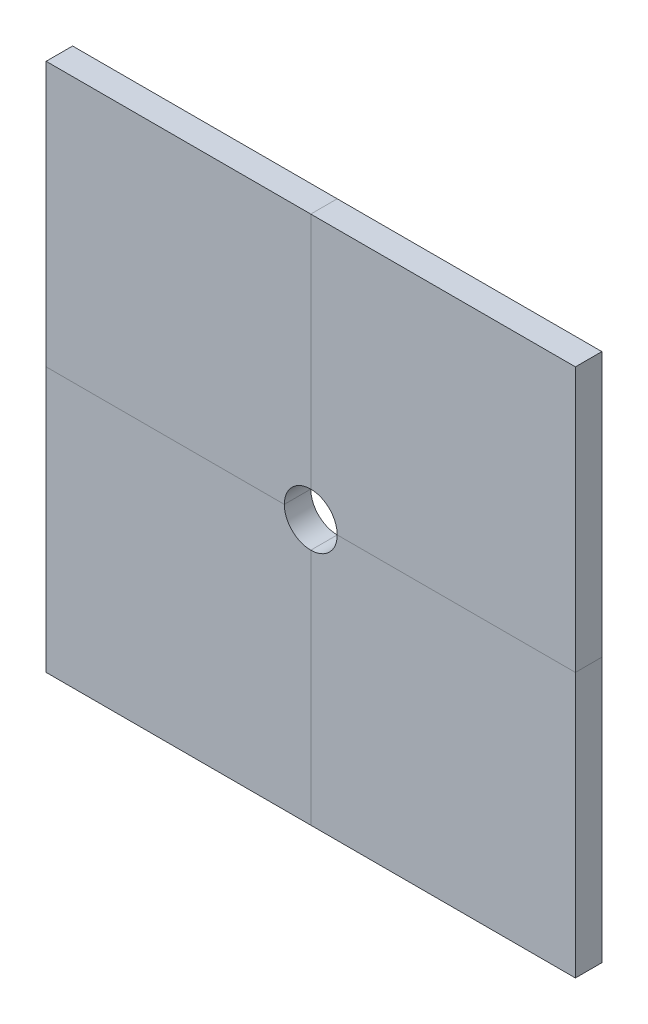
from build123d import *

# Parameters (mm, degrees)
BASE_EXTRUDE_DEPTH = 25.4


with BuildPart() as part:
    # Sketch1 → Base-Extrude (new body)
    with BuildSketch(Plane.XY):
        with BuildLine():
            Line((-25.4, -152.4), (-25.4, 76.2))
            Line((-25.4, 76.2), (228.6, 76.2))
            Line((228.6, 76.2), (228.6, -177.8))
            Line((228.6, -177.8), (0, -177.8))
            ThreePointArc((0, -177.8), (-7.439487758, -159.839487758), (-25.4, -152.4))
        make_face()
    extrude(amount=BASE_EXTRUDE_DEPTH)


with BuildPart() as body_2:
    # Mirror1: mirrored copy
    add(part.part.mirror(Plane(origin=(-25.4, -152.4, 25.4), x_dir=(0, 0, 1), z_dir=(1, 0, 0))))


with BuildPart() as body_3:
    # Mirror2: mirrored copy
    add(part.part.mirror(Plane(origin=(-279.4, -177.8, 25.4), x_dir=(0, 0, 1), z_dir=(0, 1, 0))))


with BuildPart() as body_4:
    # Mirror2 2: mirrored copy
    add(body_2.part.mirror(Plane(origin=(-279.4, -177.8, 25.4), x_dir=(0, 0, 1), z_dir=(0, 1, 0))))


solid = Compound([part.part, body_2.part, body_3.part, body_4.part])
